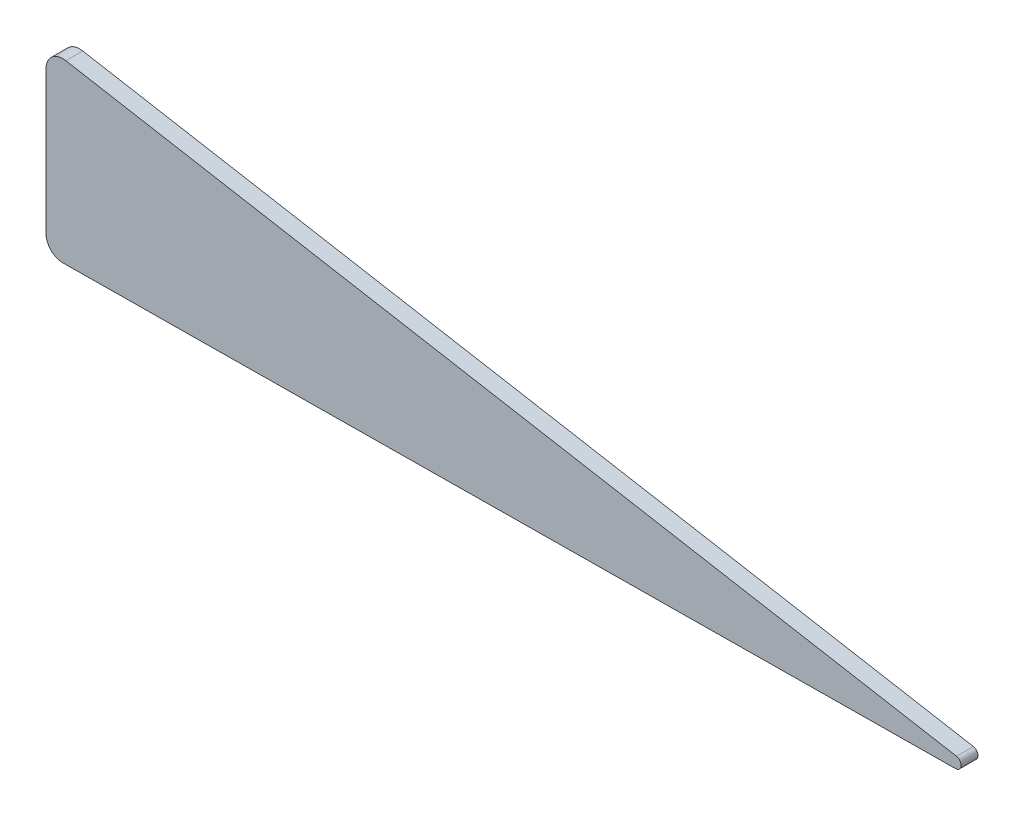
from build123d import *

# Parameters (mm, degrees)
BASE_EXTRUSION_DEPTH = 1.5


with BuildPart() as part:
    # Esquisse1 → Base-Extrusion (new, symmetric)
    with BuildSketch(Plane.XY):
        with BuildLine():
            Line((3.028051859, 0.028315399), (161.496054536, 1.51015418))
            ThreePointArc((161.496054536, 1.51015418), (162.483295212, 2.427613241), (161.660352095, 3.494918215))
            Line((161.660352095, 3.494918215), (3.520944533, 31.379162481))
            ThreePointArc((3.520944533, 31.379162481), (1.071637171, 30.722872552), (0, 28.424739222))
            Line((0, 28.424739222), (0, 3.028184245))
            ThreePointArc((0, 3.028184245), (0.88862078, 0.896969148), (3.028051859, 0.028315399))
        make_face()
    extrude(amount=BASE_EXTRUSION_DEPTH, both=True)


solid = part.part
